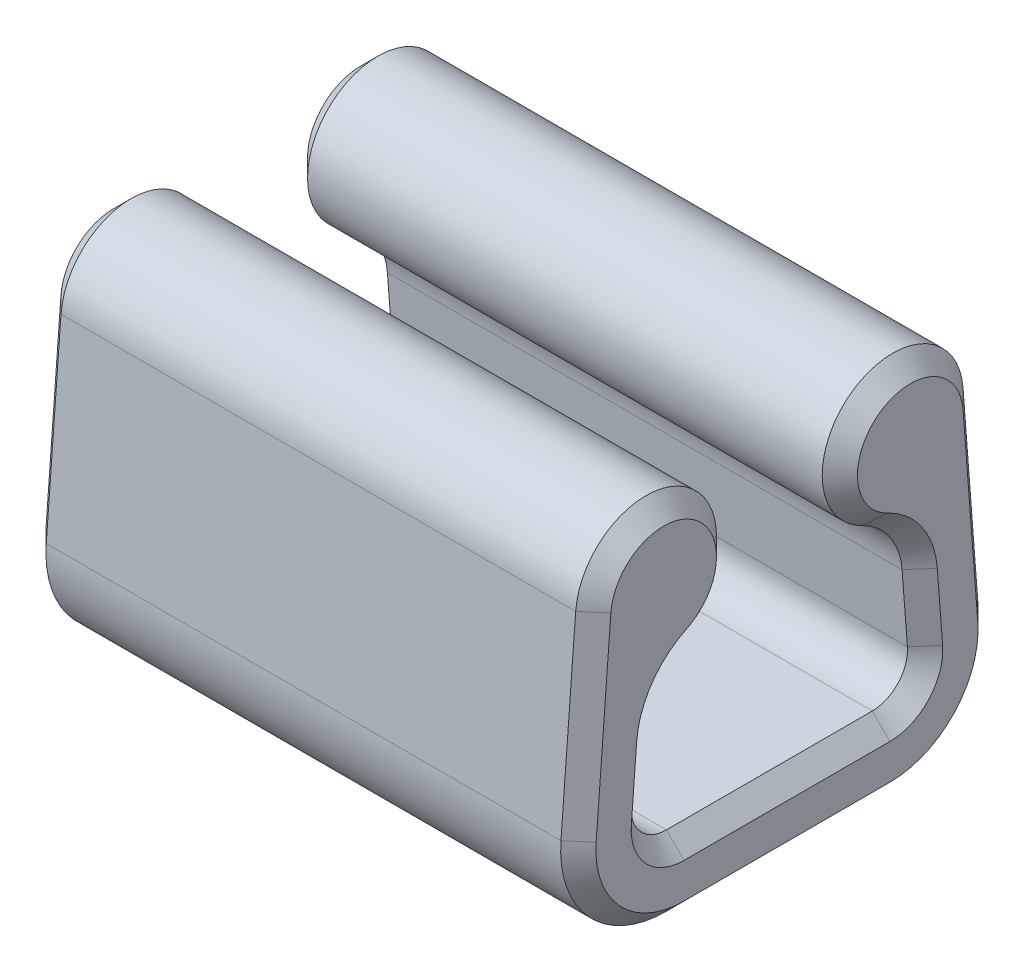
ISO-10303-21;
HEADER;
FILE_DESCRIPTION(('STEP AP214'),'2;1');
FILE_NAME('part.step','',(''),(''),'','','');
FILE_SCHEMA(('AUTOMOTIVE_DESIGN { 1 0 10303 214 1 1 1 1 }'));
ENDSEC;
DATA;
#1=APPLICATION_CONTEXT('core data for automotive mechanical design processes');
#2=APPLICATION_PROTOCOL_DEFINITION('international standard','automotive_design',2000,#1);
#3=PRODUCT_CONTEXT('',#1,'mechanical');
#4=PRODUCT('Part','Part','',(#3));
#5=PRODUCT_RELATED_PRODUCT_CATEGORY('part','',(#4));
#6=PRODUCT_DEFINITION_FORMATION('','',#4);
#7=PRODUCT_DEFINITION_CONTEXT('part definition',#1,'design');
#8=PRODUCT_DEFINITION('design','',#6,#7);
#9=PRODUCT_DEFINITION_SHAPE('','',#8);
#10=(LENGTH_UNIT() NAMED_UNIT(*) SI_UNIT(.MILLI.,.METRE.));
#11=(NAMED_UNIT(*) PLANE_ANGLE_UNIT() SI_UNIT($,.RADIAN.));
#12=(NAMED_UNIT(*) SI_UNIT($,.STERADIAN.) SOLID_ANGLE_UNIT());
#13=UNCERTAINTY_MEASURE_WITH_UNIT(LENGTH_MEASURE(1.E-05),#10,'distance_accuracy_value','');
#14=(GEOMETRIC_REPRESENTATION_CONTEXT(3) GLOBAL_UNCERTAINTY_ASSIGNED_CONTEXT((#13)) GLOBAL_UNIT_ASSIGNED_CONTEXT((#10,
#11,#12)) REPRESENTATION_CONTEXT('',''));
#15=CARTESIAN_POINT('',(0.,0.,0.));
#16=DIRECTION('',(0.,0.,1.));
#17=DIRECTION('',(1.,0.,0.));
#18=AXIS2_PLACEMENT_3D('',#15,#16,#17);
#19=CARTESIAN_POINT('',(7.8,0.,0.));
#20=DIRECTION('',(0.,1.,0.));
#21=DIRECTION('',(0.,0.,1.));
#22=AXIS2_PLACEMENT_3D('',#19,#20,#21);
#23=PLANE('',#22);
#24=DIRECTION('',(-1.,0.,0.));
#25=VECTOR('',#24,1.);
#26=CARTESIAN_POINT('',(7.8,0.,2.92));
#27=LINE('',#26,#25);
#28=CARTESIAN_POINT('',(7.29999999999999,0.,2.92));
#29=VERTEX_POINT('',#28);
#30=CARTESIAN_POINT('',(-7.3,0.,2.92));
#31=VERTEX_POINT('',#30);
#32=EDGE_CURVE('E328',#29,#31,#27,.T.);
#33=ORIENTED_EDGE('',*,*,#32,.T.);
#34=DIRECTION('',(0.,0.,-1.));
#35=VECTOR('',#34,1.);
#36=CARTESIAN_POINT('',(-7.3,0.,0.));
#37=LINE('',#36,#35);
#38=CARTESIAN_POINT('',(-7.3,0.,-2.92));
#39=VERTEX_POINT('',#38);
#40=EDGE_CURVE('E376',#31,#39,#37,.T.);
#41=ORIENTED_EDGE('',*,*,#40,.T.);
#42=DIRECTION('',(-1.,0.,0.));
#43=VECTOR('',#42,1.);
#44=CARTESIAN_POINT('',(7.8,0.,-2.92));
#45=LINE('',#44,#43);
#46=CARTESIAN_POINT('',(7.29999999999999,0.,-2.92));
#47=VERTEX_POINT('',#46);
#48=EDGE_CURVE('E247',#47,#39,#45,.T.);
#49=ORIENTED_EDGE('',*,*,#48,.F.);
#50=DIRECTION('',(0.,0.,1.));
#51=VECTOR('',#50,1.);
#52=CARTESIAN_POINT('',(7.29999999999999,0.,2.92));
#53=LINE('',#52,#51);
#54=EDGE_CURVE('E378',#47,#29,#53,.T.);
#55=ORIENTED_EDGE('',*,*,#54,.T.);
#56=EDGE_LOOP('',(#33,#41,#49,#55));
#57=FACE_BOUND('',#56,.T.);
#58=ADVANCED_FACE('F38',(#57),#23,.F.);
#59=CARTESIAN_POINT('',(7.8,3.,-2.92));
#60=DIRECTION('',(-1.,0.,0.));
#61=DIRECTION('',(0.,0.,1.));
#62=AXIS2_PLACEMENT_3D('',#59,#60,#61);
#63=CYLINDRICAL_SURFACE('',#62,3.);
#64=ORIENTED_EDGE('',*,*,#48,.T.);
#65=CARTESIAN_POINT('',(-7.3,3.,-2.92));
#66=DIRECTION('',(1.,0.,0.));
#67=DIRECTION('',(0.,0.,-1.));
#68=AXIS2_PLACEMENT_3D('',#65,#66,#67);
#69=CIRCLE('',#68,3.);
#70=CARTESIAN_POINT('',(-7.3,3.23015708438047,-5.91115825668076));
#71=VERTEX_POINT('',#70);
#72=EDGE_CURVE('E246',#39,#71,#69,.T.);
#73=ORIENTED_EDGE('',*,*,#72,.T.);
#74=DIRECTION('',(-1.,0.,0.));
#75=VECTOR('',#74,1.);
#76=CARTESIAN_POINT('',(7.8,3.23015708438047,-5.91115825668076));
#77=LINE('',#76,#75);
#78=CARTESIAN_POINT('',(7.29999999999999,3.23015708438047,-5.91115825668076));
#79=VERTEX_POINT('',#78);
#80=EDGE_CURVE('E228',#79,#71,#77,.T.);
#81=ORIENTED_EDGE('',*,*,#80,.F.);
#82=CARTESIAN_POINT('',(7.29999999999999,3.,-2.92));
#83=DIRECTION('',(1.,0.,0.));
#84=DIRECTION('',(0.,0.,-1.));
#85=AXIS2_PLACEMENT_3D('',#82,#83,#84);
#86=CIRCLE('',#85,3.);
#87=EDGE_CURVE('E243',#79,#47,#86,.F.);
#88=ORIENTED_EDGE('',*,*,#87,.T.);
#89=EDGE_LOOP('',(#64,#73,#81,#88));
#90=FACE_BOUND('',#89,.T.);
#91=ADVANCED_FACE('F242',(#90),#63,.T.);
#92=CARTESIAN_POINT('',(7.8,3.23015708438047,-5.91115825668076));
#93=DIRECTION('',(0.,-0.0767190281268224,0.99705275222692));
#94=DIRECTION('',(0.,-0.99705275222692,-0.0767190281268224));
#95=AXIS2_PLACEMENT_3D('',#92,#93,#94);
#96=PLANE('',#95);
#97=ORIENTED_EDGE('',*,*,#80,.T.);
#98=DIRECTION('',(0.,0.99705275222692,0.0767190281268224));
#99=VECTOR('',#98,1.);
#100=CARTESIAN_POINT('',(-7.3,3.23015708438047,-5.91115825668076));
#101=LINE('',#100,#99);
#102=CARTESIAN_POINT('',(-7.3,8.65412405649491,-5.49380674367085));
#103=VERTEX_POINT('',#102);
#104=EDGE_CURVE('E235',#71,#103,#101,.T.);
#105=ORIENTED_EDGE('',*,*,#104,.T.);
#106=DIRECTION('',(-1.,0.,0.));
#107=VECTOR('',#106,1.);
#108=CARTESIAN_POINT('',(7.8,8.65412405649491,-5.49380674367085));
#109=LINE('',#108,#107);
#110=CARTESIAN_POINT('',(7.29999999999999,8.65412405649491,-5.49380674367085));
#111=VERTEX_POINT('',#110);
#112=EDGE_CURVE('E230',#111,#103,#109,.T.);
#113=ORIENTED_EDGE('',*,*,#112,.F.);
#114=DIRECTION('',(0.,-0.99705275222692,-0.0767190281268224));
#115=VECTOR('',#114,1.);
#116=CARTESIAN_POINT('',(7.29999999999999,3.23015708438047,-5.91115825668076));
#117=LINE('',#116,#115);
#118=EDGE_CURVE('E225',#111,#79,#117,.T.);
#119=ORIENTED_EDGE('',*,*,#118,.T.);
#120=EDGE_LOOP('',(#97,#105,#113,#119));
#121=FACE_BOUND('',#120,.T.);
#122=ADVANCED_FACE('F227',(#121),#96,.F.);
#123=CARTESIAN_POINT('',(7.8,8.50068600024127,-3.499701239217));
#124=DIRECTION('',(-1.,0.,0.));
#125=DIRECTION('',(0.,0.,1.));
#126=AXIS2_PLACEMENT_3D('',#123,#124,#125);
#127=CYLINDRICAL_SURFACE('',#126,2.);
#128=ORIENTED_EDGE('',*,*,#112,.T.);
#129=CARTESIAN_POINT('',(-7.3,8.50068600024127,-3.499701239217));
#130=DIRECTION('',(1.,0.,0.));
#131=DIRECTION('',(0.,0.,-1.));
#132=AXIS2_PLACEMENT_3D('',#129,#130,#131);
#133=CIRCLE('',#132,2.);
#134=CARTESIAN_POINT('',(-7.3,6.69702094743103,-2.63552974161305));
#135=VERTEX_POINT('',#134);
#136=EDGE_CURVE('E421',#103,#135,#133,.T.);
#137=ORIENTED_EDGE('',*,*,#136,.T.);
#138=DIRECTION('',(-1.,0.,0.));
#139=VECTOR('',#138,1.);
#140=CARTESIAN_POINT('',(7.8,6.69702094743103,-2.63552974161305));
#141=LINE('',#140,#139);
#142=CARTESIAN_POINT('',(7.29999999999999,6.69702094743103,-2.63552974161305));
#143=VERTEX_POINT('',#142);
#144=EDGE_CURVE('E456',#143,#135,#141,.T.);
#145=ORIENTED_EDGE('',*,*,#144,.F.);
#146=CARTESIAN_POINT('',(7.29999999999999,8.50068600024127,-3.499701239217));
#147=DIRECTION('',(1.,0.,0.));
#148=DIRECTION('',(0.,0.,-1.));
#149=AXIS2_PLACEMENT_3D('',#146,#147,#148);
#150=CIRCLE('',#149,2.);
#151=EDGE_CURVE('E352',#143,#111,#150,.F.);
#152=ORIENTED_EDGE('',*,*,#151,.T.);
#153=EDGE_LOOP('',(#128,#137,#145,#152));
#154=FACE_BOUND('',#153,.T.);
#155=ADVANCED_FACE('F523',(#154),#127,.T.);
#156=CARTESIAN_POINT('',(7.8,4.8933558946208,-1.77135824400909));
#157=DIRECTION('',(-1.,0.,0.));
#158=DIRECTION('',(0.,0.,1.));
#159=AXIS2_PLACEMENT_3D('',#156,#157,#158);
#160=CYLINDRICAL_SURFACE('',#159,2.);
#161=ORIENTED_EDGE('',*,*,#144,.T.);
#162=CARTESIAN_POINT('',(-7.3,4.8933558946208,-1.77135824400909));
#163=DIRECTION('',(1.,0.,0.));
#164=DIRECTION('',(0.,0.,-1.));
#165=AXIS2_PLACEMENT_3D('',#162,#163,#164);
#166=CIRCLE('',#165,2.);
#167=CARTESIAN_POINT('',(-7.3,5.04679395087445,-3.76546374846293));
#168=VERTEX_POINT('',#167);
#169=EDGE_CURVE('E417',#135,#168,#166,.F.);
#170=ORIENTED_EDGE('',*,*,#169,.T.);
#171=DIRECTION('',(-1.,0.,0.));
#172=VECTOR('',#171,1.);
#173=CARTESIAN_POINT('',(7.8,5.04679395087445,-3.76546374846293));
#174=LINE('',#173,#172);
#175=CARTESIAN_POINT('',(7.29999999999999,5.04679395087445,-3.76546374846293));
#176=VERTEX_POINT('',#175);
#177=EDGE_CURVE('E459',#176,#168,#174,.T.);
#178=ORIENTED_EDGE('',*,*,#177,.F.);
#179=CARTESIAN_POINT('',(7.29999999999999,4.8933558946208,-1.77135824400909));
#180=DIRECTION('',(1.,0.,0.));
#181=DIRECTION('',(0.,0.,-1.));
#182=AXIS2_PLACEMENT_3D('',#179,#180,#181);
#183=CIRCLE('',#182,2.);
#184=EDGE_CURVE('E419',#176,#143,#183,.T.);
#185=ORIENTED_EDGE('',*,*,#184,.T.);
#186=EDGE_LOOP('',(#161,#170,#178,#185));
#187=FACE_BOUND('',#186,.T.);
#188=ADVANCED_FACE('F526',(#187),#160,.F.);
#189=CARTESIAN_POINT('',(7.8,5.04679395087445,-3.76546374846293));
#190=DIRECTION('',(0.,0.076719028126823,-0.99705275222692));
#191=DIRECTION('',(0.,0.99705275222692,0.076719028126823));
#192=AXIS2_PLACEMENT_3D('',#189,#190,#191);
#193=PLANE('',#192);
#194=ORIENTED_EDGE('',*,*,#177,.T.);
#195=DIRECTION('',(0.,-0.99705275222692,-0.076719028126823));
#196=VECTOR('',#195,1.);
#197=CARTESIAN_POINT('',(-7.3,5.04679395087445,-3.76546374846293));
#198=LINE('',#197,#196);
#199=CARTESIAN_POINT('',(-7.3,3.07671902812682,-3.91705275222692));
#200=VERTEX_POINT('',#199);
#201=EDGE_CURVE('E413',#168,#200,#198,.T.);
#202=ORIENTED_EDGE('',*,*,#201,.T.);
#203=DIRECTION('',(-1.,0.,0.));
#204=VECTOR('',#203,1.);
#205=CARTESIAN_POINT('',(7.8,3.07671902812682,-3.91705275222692));
#206=LINE('',#205,#204);
#207=CARTESIAN_POINT('',(7.29999999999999,3.07671902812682,-3.91705275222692));
#208=VERTEX_POINT('',#207);
#209=EDGE_CURVE('E462',#208,#200,#206,.T.);
#210=ORIENTED_EDGE('',*,*,#209,.F.);
#211=DIRECTION('',(0.,0.99705275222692,0.076719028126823));
#212=VECTOR('',#211,1.);
#213=CARTESIAN_POINT('',(7.29999999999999,5.04679395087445,-3.76546374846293));
#214=LINE('',#213,#212);
#215=EDGE_CURVE('E415',#208,#176,#214,.T.);
#216=ORIENTED_EDGE('',*,*,#215,.T.);
#217=EDGE_LOOP('',(#194,#202,#210,#216));
#218=FACE_BOUND('',#217,.T.);
#219=ADVANCED_FACE('F530',(#218),#193,.F.);
#220=CARTESIAN_POINT('',(7.8,3.,-2.92));
#221=DIRECTION('',(-1.,0.,0.));
#222=DIRECTION('',(0.,0.,1.));
#223=AXIS2_PLACEMENT_3D('',#220,#221,#222);
#224=CYLINDRICAL_SURFACE('',#223,1.);
#225=ORIENTED_EDGE('',*,*,#209,.T.);
#226=CARTESIAN_POINT('',(-7.3,3.,-2.92));
#227=DIRECTION('',(1.,0.,0.));
#228=DIRECTION('',(0.,0.,-1.));
#229=AXIS2_PLACEMENT_3D('',#226,#227,#228);
#230=CIRCLE('',#229,1.);
#231=CARTESIAN_POINT('',(-7.3,2.,-2.92));
#232=VERTEX_POINT('',#231);
#233=EDGE_CURVE('E408',#200,#232,#230,.F.);
#234=ORIENTED_EDGE('',*,*,#233,.T.);
#235=DIRECTION('',(-1.,0.,0.));
#236=VECTOR('',#235,1.);
#237=CARTESIAN_POINT('',(7.8,2.,-2.92));
#238=LINE('',#237,#236);
#239=CARTESIAN_POINT('',(7.29999999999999,2.,-2.92));
#240=VERTEX_POINT('',#239);
#241=EDGE_CURVE('E465',#240,#232,#238,.T.);
#242=ORIENTED_EDGE('',*,*,#241,.F.);
#243=CARTESIAN_POINT('',(7.29999999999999,3.,-2.92));
#244=DIRECTION('',(1.,0.,0.));
#245=DIRECTION('',(0.,0.,-1.));
#246=AXIS2_PLACEMENT_3D('',#243,#244,#245);
#247=CIRCLE('',#246,1.);
#248=EDGE_CURVE('E410',#240,#208,#247,.T.);
#249=ORIENTED_EDGE('',*,*,#248,.T.);
#250=EDGE_LOOP('',(#225,#234,#242,#249));
#251=FACE_BOUND('',#250,.T.);
#252=ADVANCED_FACE('F534',(#251),#224,.F.);
#253=CARTESIAN_POINT('',(7.8,2.,-2.92));
#254=DIRECTION('',(0.,-1.,0.));
#255=DIRECTION('',(0.,0.,-1.));
#256=AXIS2_PLACEMENT_3D('',#253,#254,#255);
#257=PLANE('',#256);
#258=ORIENTED_EDGE('',*,*,#241,.T.);
#259=DIRECTION('',(0.,0.,1.));
#260=VECTOR('',#259,1.);
#261=CARTESIAN_POINT('',(-7.3,2.,-2.92));
#262=LINE('',#261,#260);
#263=CARTESIAN_POINT('',(-7.3,2.,2.92));
#264=VERTEX_POINT('',#263);
#265=EDGE_CURVE('E404',#232,#264,#262,.T.);
#266=ORIENTED_EDGE('',*,*,#265,.T.);
#267=DIRECTION('',(-1.,0.,0.));
#268=VECTOR('',#267,1.);
#269=CARTESIAN_POINT('',(7.8,2.,2.92));
#270=LINE('',#269,#268);
#271=CARTESIAN_POINT('',(7.29999999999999,2.,2.92));
#272=VERTEX_POINT('',#271);
#273=EDGE_CURVE('E468',#272,#264,#270,.T.);
#274=ORIENTED_EDGE('',*,*,#273,.F.);
#275=DIRECTION('',(0.,0.,-1.));
#276=VECTOR('',#275,1.);
#277=CARTESIAN_POINT('',(7.29999999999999,2.,-2.92));
#278=LINE('',#277,#276);
#279=EDGE_CURVE('E406',#272,#240,#278,.T.);
#280=ORIENTED_EDGE('',*,*,#279,.T.);
#281=EDGE_LOOP('',(#258,#266,#274,#280));
#282=FACE_BOUND('',#281,.T.);
#283=ADVANCED_FACE('F538',(#282),#257,.F.);
#284=CARTESIAN_POINT('',(7.8,3.,-2.92));
#285=DIRECTION('',(1.,0.,0.));
#286=DIRECTION('',(0.,0.,-1.));
#287=AXIS2_PLACEMENT_3D('',#284,#285,#286);
#288=PLANE('',#287);
#289=DIRECTION('',(0.,-0.99705275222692,-0.076719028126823));
#290=VECTOR('',#289,1.);
#291=CARTESIAN_POINT('',(7.8,3.11507854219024,-4.41557912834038));
#292=LINE('',#291,#290);
#293=CARTESIAN_POINT('',(7.8,5.08515346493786,-4.26399012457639));
#294=VERTEX_POINT('',#293);
#295=CARTESIAN_POINT('',(7.8,3.11507854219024,-4.41557912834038));
#296=VERTEX_POINT('',#295);
#297=EDGE_CURVE('E48',#294,#296,#292,.T.);
#298=ORIENTED_EDGE('',*,*,#297,.T.);
#299=CARTESIAN_POINT('',(7.8,3.,-2.92));
#300=DIRECTION('',(1.,0.,0.));
#301=DIRECTION('',(0.,0.,-1.));
#302=AXIS2_PLACEMENT_3D('',#299,#300,#301);
#303=CIRCLE('',#302,1.5);
#304=CARTESIAN_POINT('',(7.8,1.5,-2.92));
#305=VERTEX_POINT('',#304);
#306=EDGE_CURVE('E11',#296,#305,#303,.F.);
#307=ORIENTED_EDGE('',*,*,#306,.T.);
#308=DIRECTION('',(0.,0.,1.));
#309=VECTOR('',#308,1.);
#310=CARTESIAN_POINT('',(7.8,1.5,2.92));
#311=LINE('',#310,#309);
#312=CARTESIAN_POINT('',(7.8,1.5,2.92));
#313=VERTEX_POINT('',#312);
#314=EDGE_CURVE('E374',#305,#313,#311,.T.);
#315=ORIENTED_EDGE('',*,*,#314,.T.);
#316=CARTESIAN_POINT('',(7.8,3.,2.92));
#317=DIRECTION('',(1.,0.,0.));
#318=DIRECTION('',(0.,0.,-1.));
#319=AXIS2_PLACEMENT_3D('',#316,#317,#318);
#320=CIRCLE('',#319,1.5);
#321=CARTESIAN_POINT('',(7.8,3.11507854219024,4.41557912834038));
#322=VERTEX_POINT('',#321);
#323=EDGE_CURVE('E372',#313,#322,#320,.F.);
#324=ORIENTED_EDGE('',*,*,#323,.T.);
#325=DIRECTION('',(0.,0.99705275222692,-0.076719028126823));
#326=VECTOR('',#325,1.);
#327=CARTESIAN_POINT('',(7.8,3.56179718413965,4.38120600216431));
#328=LINE('',#327,#326);
#329=CARTESIAN_POINT('',(7.8,5.08515346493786,4.26399012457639));
#330=VERTEX_POINT('',#329);
#331=EDGE_CURVE('E370',#322,#330,#328,.T.);
#332=ORIENTED_EDGE('',*,*,#331,.T.);
#333=CARTESIAN_POINT('',(7.8,4.8933558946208,1.77135824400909));
#334=DIRECTION('',(1.,0.,0.));
#335=DIRECTION('',(0.,0.,-1.));
#336=AXIS2_PLACEMENT_3D('',#333,#334,#335);
#337=CIRCLE('',#336,2.5);
#338=CARTESIAN_POINT('',(7.8,7.1479372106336,2.85157261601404));
#339=VERTEX_POINT('',#338);
#340=EDGE_CURVE('E368',#330,#339,#337,.F.);
#341=ORIENTED_EDGE('',*,*,#340,.T.);
#342=CARTESIAN_POINT('',(7.8,8.50068600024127,3.499701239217));
#343=DIRECTION('',(1.,0.,0.));
#344=DIRECTION('',(0.,0.,-1.));
#345=AXIS2_PLACEMENT_3D('',#342,#343,#344);
#346=CIRCLE('',#345,1.5);
#347=CARTESIAN_POINT('',(7.8,8.6157645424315,4.99528036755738));
#348=VERTEX_POINT('',#347);
#349=EDGE_CURVE('E366',#339,#348,#346,.T.);
#350=ORIENTED_EDGE('',*,*,#349,.T.);
#351=DIRECTION('',(0.,-0.99705275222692,0.0767190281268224));
#352=VECTOR('',#351,1.);
#353=CARTESIAN_POINT('',(7.8,3.63851621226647,5.37825875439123));
#354=LINE('',#353,#352);
#355=CARTESIAN_POINT('',(7.8,3.19179757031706,5.4126318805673));
#356=VERTEX_POINT('',#355);
#357=EDGE_CURVE('E364',#348,#356,#354,.T.);
#358=ORIENTED_EDGE('',*,*,#357,.T.);
#359=CARTESIAN_POINT('',(7.8,3.,2.92));
#360=DIRECTION('',(1.,0.,0.));
#361=DIRECTION('',(0.,0.,-1.));
#362=AXIS2_PLACEMENT_3D('',#359,#360,#361);
#363=CIRCLE('',#362,2.5);
#364=CARTESIAN_POINT('',(7.8,0.500000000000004,2.92));
#365=VERTEX_POINT('',#364);
#366=EDGE_CURVE('E362',#356,#365,#363,.T.);
#367=ORIENTED_EDGE('',*,*,#366,.T.);
#368=DIRECTION('',(0.,0.,-1.));
#369=VECTOR('',#368,1.);
#370=CARTESIAN_POINT('',(7.8,0.500000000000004,-2.92));
#371=LINE('',#370,#369);
#372=CARTESIAN_POINT('',(7.8,0.500000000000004,-2.92));
#373=VERTEX_POINT('',#372);
#374=EDGE_CURVE('E360',#365,#373,#371,.T.);
#375=ORIENTED_EDGE('',*,*,#374,.T.);
#376=CARTESIAN_POINT('',(7.8,3.,-2.92));
#377=DIRECTION('',(1.,0.,0.));
#378=DIRECTION('',(0.,0.,-1.));
#379=AXIS2_PLACEMENT_3D('',#376,#377,#378);
#380=CIRCLE('',#379,2.5);
#381=CARTESIAN_POINT('',(7.8,3.19179757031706,-5.4126318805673));
#382=VERTEX_POINT('',#381);
#383=EDGE_CURVE('E356',#373,#382,#380,.T.);
#384=ORIENTED_EDGE('',*,*,#383,.T.);
#385=DIRECTION('',(0.,0.99705275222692,0.0767190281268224));
#386=VECTOR('',#385,1.);
#387=CARTESIAN_POINT('',(7.8,8.6157645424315,-4.99528036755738));
#388=LINE('',#387,#386);
#389=CARTESIAN_POINT('',(7.8,8.6157645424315,-4.99528036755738));
#390=VERTEX_POINT('',#389);
#391=EDGE_CURVE('E260',#382,#390,#388,.T.);
#392=ORIENTED_EDGE('',*,*,#391,.T.);
#393=CARTESIAN_POINT('',(7.8,8.50068600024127,-3.499701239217));
#394=DIRECTION('',(1.,0.,0.));
#395=DIRECTION('',(0.,0.,-1.));
#396=AXIS2_PLACEMENT_3D('',#393,#394,#395);
#397=CIRCLE('',#396,1.5);
#398=CARTESIAN_POINT('',(7.8,7.1479372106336,-2.85157261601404));
#399=VERTEX_POINT('',#398);
#400=EDGE_CURVE('E353',#390,#399,#397,.T.);
#401=ORIENTED_EDGE('',*,*,#400,.T.);
#402=CARTESIAN_POINT('',(7.8,4.8933558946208,-1.77135824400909));
#403=DIRECTION('',(1.,0.,0.));
#404=DIRECTION('',(0.,0.,-1.));
#405=AXIS2_PLACEMENT_3D('',#402,#403,#404);
#406=CIRCLE('',#405,2.5);
#407=EDGE_CURVE('E59',#399,#294,#406,.F.);
#408=ORIENTED_EDGE('',*,*,#407,.T.);
#409=EDGE_LOOP('',(#298,#307,#315,#324,#332,#341,#350,#358,#367,#375,#384,#392,#401,#408));
#410=FACE_BOUND('',#409,.T.);
#411=ADVANCED_FACE('F542',(#410),#288,.T.);
#412=CARTESIAN_POINT('',(-7.8,3.,-2.92));
#413=DIRECTION('',(1.,0.,0.));
#414=DIRECTION('',(0.,0.,-1.));
#415=AXIS2_PLACEMENT_3D('',#412,#413,#414);
#416=PLANE('',#415);
#417=DIRECTION('',(0.,-0.99705275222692,-0.0767190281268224));
#418=VECTOR('',#417,1.);
#419=CARTESIAN_POINT('',(-7.8,3.19179757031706,-5.41263188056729));
#420=LINE('',#419,#418);
#421=CARTESIAN_POINT('',(-7.8,8.6157645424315,-4.99528036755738));
#422=VERTEX_POINT('',#421);
#423=CARTESIAN_POINT('',(-7.8,3.19179757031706,-5.41263188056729));
#424=VERTEX_POINT('',#423);
#425=EDGE_CURVE('E427',#422,#424,#420,.T.);
#426=ORIENTED_EDGE('',*,*,#425,.T.);
#427=CARTESIAN_POINT('',(-7.8,3.,-2.92));
#428=DIRECTION('',(1.,0.,0.));
#429=DIRECTION('',(0.,0.,-1.));
#430=AXIS2_PLACEMENT_3D('',#427,#428,#429);
#431=CIRCLE('',#430,2.49999999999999);
#432=CARTESIAN_POINT('',(-7.8,0.500000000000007,-2.92));
#433=VERTEX_POINT('',#432);
#434=EDGE_CURVE('E236',#424,#433,#431,.F.);
#435=ORIENTED_EDGE('',*,*,#434,.T.);
#436=DIRECTION('',(0.,0.,1.));
#437=VECTOR('',#436,1.);
#438=CARTESIAN_POINT('',(-7.8,0.500000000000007,-2.92));
#439=LINE('',#438,#437);
#440=CARTESIAN_POINT('',(-7.8,0.500000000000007,2.92));
#441=VERTEX_POINT('',#440);
#442=EDGE_CURVE('E451',#433,#441,#439,.T.);
#443=ORIENTED_EDGE('',*,*,#442,.T.);
#444=CARTESIAN_POINT('',(-7.8,3.,2.92));
#445=DIRECTION('',(1.,0.,0.));
#446=DIRECTION('',(0.,0.,-1.));
#447=AXIS2_PLACEMENT_3D('',#444,#445,#446);
#448=CIRCLE('',#447,2.49999999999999);
#449=CARTESIAN_POINT('',(-7.8,3.19179757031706,5.41263188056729));
#450=VERTEX_POINT('',#449);
#451=EDGE_CURVE('E449',#441,#450,#448,.F.);
#452=ORIENTED_EDGE('',*,*,#451,.T.);
#453=DIRECTION('',(0.,0.99705275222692,-0.0767190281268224));
#454=VECTOR('',#453,1.);
#455=CARTESIAN_POINT('',(-7.8,8.6157645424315,4.99528036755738));
#456=LINE('',#455,#454);
#457=CARTESIAN_POINT('',(-7.8,8.6157645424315,4.99528036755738));
#458=VERTEX_POINT('',#457);
#459=EDGE_CURVE('E447',#450,#458,#456,.T.);
#460=ORIENTED_EDGE('',*,*,#459,.T.);
#461=CARTESIAN_POINT('',(-7.8,8.50068600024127,3.499701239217));
#462=DIRECTION('',(1.,0.,0.));
#463=DIRECTION('',(0.,0.,-1.));
#464=AXIS2_PLACEMENT_3D('',#461,#462,#463);
#465=CIRCLE('',#464,1.49999999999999);
#466=CARTESIAN_POINT('',(-7.8,7.1479372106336,2.85157261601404));
#467=VERTEX_POINT('',#466);
#468=EDGE_CURVE('E445',#458,#467,#465,.F.);
#469=ORIENTED_EDGE('',*,*,#468,.T.);
#470=CARTESIAN_POINT('',(-7.8,4.8933558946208,1.77135824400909));
#471=DIRECTION('',(1.,0.,0.));
#472=DIRECTION('',(0.,0.,-1.));
#473=AXIS2_PLACEMENT_3D('',#470,#471,#472);
#474=CIRCLE('',#473,2.50000000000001);
#475=CARTESIAN_POINT('',(-7.8,5.08515346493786,4.2639901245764));
#476=VERTEX_POINT('',#475);
#477=EDGE_CURVE('E443',#467,#476,#474,.T.);
#478=ORIENTED_EDGE('',*,*,#477,.T.);
#479=DIRECTION('',(0.,-0.99705275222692,0.076719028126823));
#480=VECTOR('',#479,1.);
#481=CARTESIAN_POINT('',(-7.8,3.11507854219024,4.41557912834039));
#482=LINE('',#481,#480);
#483=CARTESIAN_POINT('',(-7.8,3.11507854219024,4.41557912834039));
#484=VERTEX_POINT('',#483);
#485=EDGE_CURVE('E441',#476,#484,#482,.T.);
#486=ORIENTED_EDGE('',*,*,#485,.T.);
#487=CARTESIAN_POINT('',(-7.8,3.,2.92));
#488=DIRECTION('',(1.,0.,0.));
#489=DIRECTION('',(0.,0.,-1.));
#490=AXIS2_PLACEMENT_3D('',#487,#488,#489);
#491=CIRCLE('',#490,1.50000000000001);
#492=CARTESIAN_POINT('',(-7.8,1.49999999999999,2.92));
#493=VERTEX_POINT('',#492);
#494=EDGE_CURVE('E439',#484,#493,#491,.T.);
#495=ORIENTED_EDGE('',*,*,#494,.T.);
#496=DIRECTION('',(0.,0.,-1.));
#497=VECTOR('',#496,1.);
#498=CARTESIAN_POINT('',(-7.8,1.49999999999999,-2.92));
#499=LINE('',#498,#497);
#500=CARTESIAN_POINT('',(-7.8,1.49999999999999,-2.92));
#501=VERTEX_POINT('',#500);
#502=EDGE_CURVE('E437',#493,#501,#499,.T.);
#503=ORIENTED_EDGE('',*,*,#502,.T.);
#504=CARTESIAN_POINT('',(-7.8,3.,-2.92));
#505=DIRECTION('',(1.,0.,0.));
#506=DIRECTION('',(0.,0.,-1.));
#507=AXIS2_PLACEMENT_3D('',#504,#505,#506);
#508=CIRCLE('',#507,1.50000000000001);
#509=CARTESIAN_POINT('',(-7.8,3.11507854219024,-4.41557912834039));
#510=VERTEX_POINT('',#509);
#511=EDGE_CURVE('E435',#501,#510,#508,.T.);
#512=ORIENTED_EDGE('',*,*,#511,.T.);
#513=DIRECTION('',(0.,0.99705275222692,0.076719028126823));
#514=VECTOR('',#513,1.);
#515=CARTESIAN_POINT('',(-7.8,3.11507854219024,-4.41557912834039));
#516=LINE('',#515,#514);
#517=CARTESIAN_POINT('',(-7.8,5.08515346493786,-4.2639901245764));
#518=VERTEX_POINT('',#517);
#519=EDGE_CURVE('E433',#510,#518,#516,.T.);
#520=ORIENTED_EDGE('',*,*,#519,.T.);
#521=CARTESIAN_POINT('',(-7.8,4.8933558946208,-1.77135824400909));
#522=DIRECTION('',(1.,0.,0.));
#523=DIRECTION('',(0.,0.,-1.));
#524=AXIS2_PLACEMENT_3D('',#521,#522,#523);
#525=CIRCLE('',#524,2.50000000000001);
#526=CARTESIAN_POINT('',(-7.8,7.1479372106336,-2.85157261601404));
#527=VERTEX_POINT('',#526);
#528=EDGE_CURVE('E431',#518,#527,#525,.T.);
#529=ORIENTED_EDGE('',*,*,#528,.T.);
#530=CARTESIAN_POINT('',(-7.8,8.50068600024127,-3.499701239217));
#531=DIRECTION('',(1.,0.,0.));
#532=DIRECTION('',(0.,0.,-1.));
#533=AXIS2_PLACEMENT_3D('',#530,#531,#532);
#534=CIRCLE('',#533,1.49999999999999);
#535=EDGE_CURVE('E429',#527,#422,#534,.F.);
#536=ORIENTED_EDGE('',*,*,#535,.T.);
#537=EDGE_LOOP('',(#426,#435,#443,#452,#460,#469,#478,#486,#495,#503,#512,#520,#529,#536));
#538=FACE_BOUND('',#537,.T.);
#539=ADVANCED_FACE('F544',(#538),#416,.F.);
#540=CARTESIAN_POINT('',(7.8,3.,2.92));
#541=DIRECTION('',(-1.,0.,0.));
#542=DIRECTION('',(0.,0.,1.));
#543=AXIS2_PLACEMENT_3D('',#540,#541,#542);
#544=CYLINDRICAL_SURFACE('',#543,1.);
#545=ORIENTED_EDGE('',*,*,#273,.T.);
#546=CARTESIAN_POINT('',(-7.3,3.,2.92));
#547=DIRECTION('',(1.,0.,0.));
#548=DIRECTION('',(0.,0.,-1.));
#549=AXIS2_PLACEMENT_3D('',#546,#547,#548);
#550=CIRCLE('',#549,1.);
#551=CARTESIAN_POINT('',(-7.3,3.07671902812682,3.91705275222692));
#552=VERTEX_POINT('',#551);
#553=EDGE_CURVE('E400',#264,#552,#550,.F.);
#554=ORIENTED_EDGE('',*,*,#553,.T.);
#555=DIRECTION('',(-1.,0.,0.));
#556=VECTOR('',#555,1.);
#557=CARTESIAN_POINT('',(7.8,3.07671902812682,3.91705275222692));
#558=LINE('',#557,#556);
#559=CARTESIAN_POINT('',(7.29999999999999,3.07671902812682,3.91705275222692));
#560=VERTEX_POINT('',#559);
#561=EDGE_CURVE('E471',#560,#552,#558,.T.);
#562=ORIENTED_EDGE('',*,*,#561,.F.);
#563=CARTESIAN_POINT('',(7.29999999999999,3.,2.92));
#564=DIRECTION('',(1.,0.,0.));
#565=DIRECTION('',(0.,0.,-1.));
#566=AXIS2_PLACEMENT_3D('',#563,#564,#565);
#567=CIRCLE('',#566,1.);
#568=EDGE_CURVE('E402',#560,#272,#567,.T.);
#569=ORIENTED_EDGE('',*,*,#568,.T.);
#570=EDGE_LOOP('',(#545,#554,#562,#569));
#571=FACE_BOUND('',#570,.T.);
#572=ADVANCED_FACE('F547',(#571),#544,.F.);
#573=CARTESIAN_POINT('',(7.8,5.04679395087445,3.76546374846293));
#574=DIRECTION('',(0.,-0.076719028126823,-0.99705275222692));
#575=DIRECTION('',(0.,0.99705275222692,-0.076719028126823));
#576=AXIS2_PLACEMENT_3D('',#573,#574,#575);
#577=PLANE('',#576);
#578=ORIENTED_EDGE('',*,*,#561,.T.);
#579=DIRECTION('',(0.,0.99705275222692,-0.076719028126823));
#580=VECTOR('',#579,1.);
#581=CARTESIAN_POINT('',(-7.3,5.04679395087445,3.76546374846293));
#582=LINE('',#581,#580);
#583=CARTESIAN_POINT('',(-7.3,5.04679395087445,3.76546374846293));
#584=VERTEX_POINT('',#583);
#585=EDGE_CURVE('E396',#552,#584,#582,.T.);
#586=ORIENTED_EDGE('',*,*,#585,.T.);
#587=DIRECTION('',(-1.,0.,0.));
#588=VECTOR('',#587,1.);
#589=CARTESIAN_POINT('',(7.8,5.04679395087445,3.76546374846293));
#590=LINE('',#589,#588);
#591=CARTESIAN_POINT('',(7.29999999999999,5.04679395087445,3.76546374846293));
#592=VERTEX_POINT('',#591);
#593=EDGE_CURVE('E474',#592,#584,#590,.T.);
#594=ORIENTED_EDGE('',*,*,#593,.F.);
#595=DIRECTION('',(0.,-0.99705275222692,0.076719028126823));
#596=VECTOR('',#595,1.);
#597=CARTESIAN_POINT('',(7.29999999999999,5.04679395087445,3.76546374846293));
#598=LINE('',#597,#596);
#599=EDGE_CURVE('E398',#592,#560,#598,.T.);
#600=ORIENTED_EDGE('',*,*,#599,.T.);
#601=EDGE_LOOP('',(#578,#586,#594,#600));
#602=FACE_BOUND('',#601,.T.);
#603=ADVANCED_FACE('F553',(#602),#577,.T.);
#604=CARTESIAN_POINT('',(7.8,4.8933558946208,1.77135824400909));
#605=DIRECTION('',(-1.,0.,0.));
#606=DIRECTION('',(0.,0.,1.));
#607=AXIS2_PLACEMENT_3D('',#604,#605,#606);
#608=CYLINDRICAL_SURFACE('',#607,2.);
#609=ORIENTED_EDGE('',*,*,#593,.T.);
#610=CARTESIAN_POINT('',(-7.3,4.8933558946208,1.77135824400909));
#611=DIRECTION('',(1.,0.,0.));
#612=DIRECTION('',(0.,0.,-1.));
#613=AXIS2_PLACEMENT_3D('',#610,#611,#612);
#614=CIRCLE('',#613,2.);
#615=CARTESIAN_POINT('',(-7.3,6.69702094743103,2.63552974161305));
#616=VERTEX_POINT('',#615);
#617=EDGE_CURVE('E392',#584,#616,#614,.F.);
#618=ORIENTED_EDGE('',*,*,#617,.T.);
#619=DIRECTION('',(-1.,0.,0.));
#620=VECTOR('',#619,1.);
#621=CARTESIAN_POINT('',(7.8,6.69702094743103,2.63552974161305));
#622=LINE('',#621,#620);
#623=CARTESIAN_POINT('',(7.29999999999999,6.69702094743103,2.63552974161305));
#624=VERTEX_POINT('',#623);
#625=EDGE_CURVE('E477',#624,#616,#622,.T.);
#626=ORIENTED_EDGE('',*,*,#625,.F.);
#627=CARTESIAN_POINT('',(7.29999999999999,4.8933558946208,1.77135824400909));
#628=DIRECTION('',(1.,0.,0.));
#629=DIRECTION('',(0.,0.,-1.));
#630=AXIS2_PLACEMENT_3D('',#627,#628,#629);
#631=CIRCLE('',#630,2.);
#632=EDGE_CURVE('E394',#624,#592,#631,.T.);
#633=ORIENTED_EDGE('',*,*,#632,.T.);
#634=EDGE_LOOP('',(#609,#618,#626,#633));
#635=FACE_BOUND('',#634,.T.);
#636=ADVANCED_FACE('F557',(#635),#608,.F.);
#637=CARTESIAN_POINT('',(7.8,8.50068600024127,3.499701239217));
#638=DIRECTION('',(-1.,0.,0.));
#639=DIRECTION('',(0.,0.,1.));
#640=AXIS2_PLACEMENT_3D('',#637,#638,#639);
#641=CYLINDRICAL_SURFACE('',#640,2.);
#642=ORIENTED_EDGE('',*,*,#625,.T.);
#643=CARTESIAN_POINT('',(-7.3,8.50068600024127,3.499701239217));
#644=DIRECTION('',(1.,0.,0.));
#645=DIRECTION('',(0.,0.,-1.));
#646=AXIS2_PLACEMENT_3D('',#643,#644,#645);
#647=CIRCLE('',#646,2.);
#648=CARTESIAN_POINT('',(-7.3,8.65412405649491,5.49380674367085));
#649=VERTEX_POINT('',#648);
#650=EDGE_CURVE('E388',#616,#649,#647,.T.);
#651=ORIENTED_EDGE('',*,*,#650,.T.);
#652=DIRECTION('',(-1.,0.,0.));
#653=VECTOR('',#652,1.);
#654=CARTESIAN_POINT('',(7.8,8.65412405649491,5.49380674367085));
#655=LINE('',#654,#653);
#656=CARTESIAN_POINT('',(7.29999999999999,8.65412405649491,5.49380674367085));
#657=VERTEX_POINT('',#656);
#658=EDGE_CURVE('E480',#657,#649,#655,.T.);
#659=ORIENTED_EDGE('',*,*,#658,.F.);
#660=CARTESIAN_POINT('',(7.29999999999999,8.50068600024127,3.499701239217));
#661=DIRECTION('',(1.,0.,0.));
#662=DIRECTION('',(0.,0.,-1.));
#663=AXIS2_PLACEMENT_3D('',#660,#661,#662);
#664=CIRCLE('',#663,2.);
#665=EDGE_CURVE('E390',#657,#624,#664,.F.);
#666=ORIENTED_EDGE('',*,*,#665,.T.);
#667=EDGE_LOOP('',(#642,#651,#659,#666));
#668=FACE_BOUND('',#667,.T.);
#669=ADVANCED_FACE('F561',(#668),#641,.T.);
#670=CARTESIAN_POINT('',(7.8,3.23015708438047,5.91115825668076));
#671=DIRECTION('',(0.,0.0767190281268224,0.99705275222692));
#672=DIRECTION('',(0.,-0.99705275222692,0.0767190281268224));
#673=AXIS2_PLACEMENT_3D('',#670,#671,#672);
#674=PLANE('',#673);
#675=ORIENTED_EDGE('',*,*,#658,.T.);
#676=DIRECTION('',(0.,-0.99705275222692,0.0767190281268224));
#677=VECTOR('',#676,1.);
#678=CARTESIAN_POINT('',(-7.3,3.23015708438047,5.91115825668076));
#679=LINE('',#678,#677);
#680=CARTESIAN_POINT('',(-7.3,3.23015708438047,5.91115825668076));
#681=VERTEX_POINT('',#680);
#682=EDGE_CURVE('E384',#649,#681,#679,.T.);
#683=ORIENTED_EDGE('',*,*,#682,.T.);
#684=DIRECTION('',(-1.,0.,0.));
#685=VECTOR('',#684,1.);
#686=CARTESIAN_POINT('',(7.8,3.23015708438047,5.91115825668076));
#687=LINE('',#686,#685);
#688=CARTESIAN_POINT('',(7.29999999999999,3.23015708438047,5.91115825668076));
#689=VERTEX_POINT('',#688);
#690=EDGE_CURVE('E483',#689,#681,#687,.T.);
#691=ORIENTED_EDGE('',*,*,#690,.F.);
#692=DIRECTION('',(0.,0.99705275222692,-0.0767190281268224));
#693=VECTOR('',#692,1.);
#694=CARTESIAN_POINT('',(7.29999999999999,3.23015708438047,5.91115825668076));
#695=LINE('',#694,#693);
#696=EDGE_CURVE('E386',#689,#657,#695,.T.);
#697=ORIENTED_EDGE('',*,*,#696,.T.);
#698=EDGE_LOOP('',(#675,#683,#691,#697));
#699=FACE_BOUND('',#698,.T.);
#700=ADVANCED_FACE('F565',(#699),#674,.T.);
#701=CARTESIAN_POINT('',(7.8,3.,2.92));
#702=DIRECTION('',(-1.,0.,0.));
#703=DIRECTION('',(0.,0.,1.));
#704=AXIS2_PLACEMENT_3D('',#701,#702,#703);
#705=CYLINDRICAL_SURFACE('',#704,3.);
#706=ORIENTED_EDGE('',*,*,#690,.T.);
#707=CARTESIAN_POINT('',(-7.3,3.,2.92));
#708=DIRECTION('',(1.,0.,0.));
#709=DIRECTION('',(0.,0.,-1.));
#710=AXIS2_PLACEMENT_3D('',#707,#708,#709);
#711=CIRCLE('',#710,3.);
#712=EDGE_CURVE('E380',#681,#31,#711,.T.);
#713=ORIENTED_EDGE('',*,*,#712,.T.);
#714=ORIENTED_EDGE('',*,*,#32,.F.);
#715=CARTESIAN_POINT('',(7.29999999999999,3.,2.92));
#716=DIRECTION('',(1.,0.,0.));
#717=DIRECTION('',(0.,0.,-1.));
#718=AXIS2_PLACEMENT_3D('',#715,#716,#717);
#719=CIRCLE('',#718,3.);
#720=EDGE_CURVE('E382',#29,#689,#719,.F.);
#721=ORIENTED_EDGE('',*,*,#720,.T.);
#722=EDGE_LOOP('',(#706,#713,#714,#721));
#723=FACE_BOUND('',#722,.T.);
#724=ADVANCED_FACE('F569',(#723),#705,.T.);
#725=CARTESIAN_POINT('',(-7.8,3.,2.92));
#726=DIRECTION('',(-1.,0.,0.));
#727=DIRECTION('',(0.,0.,1.));
#728=AXIS2_PLACEMENT_3D('',#725,#726,#727);
#729=CONICAL_SURFACE('',#728,1.50000000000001,0.785398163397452);
#730=DIRECTION('',(0.707106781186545,0.70710678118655,0.));
#731=VECTOR('',#730,1.);
#732=CARTESIAN_POINT('',(-7.8,1.49999999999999,2.92));
#733=LINE('',#732,#731);
#734=EDGE_CURVE('E322',#493,#264,#733,.T.);
#735=ORIENTED_EDGE('',*,*,#734,.F.);
#736=ORIENTED_EDGE('',*,*,#494,.F.);
#737=DIRECTION('',(-0.707106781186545,0.0542485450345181,0.705022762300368));
#738=VECTOR('',#737,1.);
#739=CARTESIAN_POINT('',(-7.3,3.07671902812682,3.91705275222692));
#740=LINE('',#739,#738);
#741=EDGE_CURVE('E325',#552,#484,#740,.T.);
#742=ORIENTED_EDGE('',*,*,#741,.F.);
#743=ORIENTED_EDGE('',*,*,#553,.F.);
#744=EDGE_LOOP('',(#735,#736,#742,#743));
#745=FACE_BOUND('',#744,.T.);
#746=ADVANCED_FACE('F572',(#745),#729,.F.);
#747=CARTESIAN_POINT('',(-7.8,3.56179718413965,4.38120600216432));
#748=DIRECTION('',(-0.70710678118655,-0.0542485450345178,-0.705022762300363));
#749=DIRECTION('',(0.,0.99705275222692,-0.076719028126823));
#750=AXIS2_PLACEMENT_3D('',#747,#748,#749);
#751=PLANE('',#750);
#752=ORIENTED_EDGE('',*,*,#741,.T.);
#753=ORIENTED_EDGE('',*,*,#485,.F.);
#754=DIRECTION('',(-0.707106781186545,0.0542485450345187,0.705022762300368));
#755=VECTOR('',#754,1.);
#756=CARTESIAN_POINT('',(-7.3,5.04679395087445,3.76546374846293));
#757=LINE('',#756,#755);
#758=EDGE_CURVE('E319',#584,#476,#757,.T.);
#759=ORIENTED_EDGE('',*,*,#758,.F.);
#760=ORIENTED_EDGE('',*,*,#585,.F.);
#761=EDGE_LOOP('',(#752,#753,#759,#760));
#762=FACE_BOUND('',#761,.T.);
#763=ADVANCED_FACE('F576',(#762),#751,.T.);
#764=CARTESIAN_POINT('',(-7.3,2.,-2.92));
#765=DIRECTION('',(0.70710678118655,-0.707106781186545,0.));
#766=DIRECTION('',(0.,0.,1.));
#767=AXIS2_PLACEMENT_3D('',#764,#765,#766);
#768=PLANE('',#767);
#769=ORIENTED_EDGE('',*,*,#734,.T.);
#770=ORIENTED_EDGE('',*,*,#265,.F.);
#771=DIRECTION('',(0.707106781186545,0.70710678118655,0.));
#772=VECTOR('',#771,1.);
#773=CARTESIAN_POINT('',(-7.8,1.49999999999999,-2.92));
#774=LINE('',#773,#772);
#775=EDGE_CURVE('E316',#501,#232,#774,.T.);
#776=ORIENTED_EDGE('',*,*,#775,.F.);
#777=ORIENTED_EDGE('',*,*,#502,.F.);
#778=EDGE_LOOP('',(#769,#770,#776,#777));
#779=FACE_BOUND('',#778,.T.);
#780=ADVANCED_FACE('F609',(#779),#768,.F.);
#781=CARTESIAN_POINT('',(-7.8,4.8933558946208,1.77135824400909));
#782=DIRECTION('',(-1.,0.,0.));
#783=DIRECTION('',(0.,0.,1.));
#784=AXIS2_PLACEMENT_3D('',#781,#782,#783);
#785=CONICAL_SURFACE('',#784,2.50000000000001,0.785398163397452);
#786=ORIENTED_EDGE('',*,*,#758,.T.);
#787=ORIENTED_EDGE('',*,*,#477,.F.);
#788=DIRECTION('',(-0.707106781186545,0.637691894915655,0.305530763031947));
#789=VECTOR('',#788,1.);
#790=CARTESIAN_POINT('',(-7.3,6.69702094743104,2.63552974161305));
#791=LINE('',#790,#789);
#792=EDGE_CURVE('E313',#616,#467,#791,.T.);
#793=ORIENTED_EDGE('',*,*,#792,.F.);
#794=ORIENTED_EDGE('',*,*,#617,.F.);
#795=EDGE_LOOP('',(#786,#787,#793,#794));
#796=FACE_BOUND('',#795,.T.);
#797=ADVANCED_FACE('F594',(#796),#785,.F.);
#798=CARTESIAN_POINT('',(-7.3,3.,-2.92));
#799=DIRECTION('',(-1.,0.,0.));
#800=DIRECTION('',(0.,0.,1.));
#801=AXIS2_PLACEMENT_3D('',#798,#799,#800);
#802=CONICAL_SURFACE('',#801,1.,0.785398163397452);
#803=ORIENTED_EDGE('',*,*,#775,.T.);
#804=ORIENTED_EDGE('',*,*,#233,.F.);
#805=DIRECTION('',(0.707106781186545,-0.0542485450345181,0.705022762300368));
#806=VECTOR('',#805,1.);
#807=CARTESIAN_POINT('',(-7.8,3.11507854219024,-4.41557912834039));
#808=LINE('',#807,#806);
#809=EDGE_CURVE('E310',#510,#200,#808,.T.);
#810=ORIENTED_EDGE('',*,*,#809,.F.);
#811=ORIENTED_EDGE('',*,*,#511,.F.);
#812=EDGE_LOOP('',(#803,#804,#810,#811));
#813=FACE_BOUND('',#812,.T.);
#814=ADVANCED_FACE('F612',(#813),#802,.F.);
#815=CARTESIAN_POINT('',(-7.8,8.50068600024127,3.499701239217));
#816=DIRECTION('',(1.,0.,0.));
#817=DIRECTION('',(0.,0.,-1.));
#818=AXIS2_PLACEMENT_3D('',#815,#816,#817);
#819=CONICAL_SURFACE('',#818,1.49999999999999,0.785398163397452);
#820=ORIENTED_EDGE('',*,*,#792,.T.);
#821=ORIENTED_EDGE('',*,*,#468,.F.);
#822=DIRECTION('',(-0.707106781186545,-0.0542485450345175,-0.705022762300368));
#823=VECTOR('',#822,1.);
#824=CARTESIAN_POINT('',(-7.3,8.65412405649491,5.49380674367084));
#825=LINE('',#824,#823);
#826=EDGE_CURVE('E307',#649,#458,#825,.T.);
#827=ORIENTED_EDGE('',*,*,#826,.F.);
#828=ORIENTED_EDGE('',*,*,#650,.F.);
#829=EDGE_LOOP('',(#820,#821,#827,#828));
#830=FACE_BOUND('',#829,.T.);
#831=ADVANCED_FACE('F589',(#830),#819,.T.);
#832=CARTESIAN_POINT('',(-7.3,5.04679395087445,-3.76546374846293));
#833=DIRECTION('',(0.70710678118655,0.0542485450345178,-0.705022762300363));
#834=DIRECTION('',(0.,-0.99705275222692,-0.076719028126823));
#835=AXIS2_PLACEMENT_3D('',#832,#833,#834);
#836=PLANE('',#835);
#837=ORIENTED_EDGE('',*,*,#809,.T.);
#838=ORIENTED_EDGE('',*,*,#201,.F.);
#839=DIRECTION('',(0.707106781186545,-0.0542485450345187,0.705022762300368));
#840=VECTOR('',#839,1.);
#841=CARTESIAN_POINT('',(-7.8,5.08515346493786,-4.2639901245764));
#842=LINE('',#841,#840);
#843=EDGE_CURVE('E304',#518,#168,#842,.T.);
#844=ORIENTED_EDGE('',*,*,#843,.F.);
#845=ORIENTED_EDGE('',*,*,#519,.F.);
#846=EDGE_LOOP('',(#837,#838,#844,#845));
#847=FACE_BOUND('',#846,.T.);
#848=ADVANCED_FACE('F617',(#847),#836,.F.);
#849=CARTESIAN_POINT('',(-7.8,3.63851621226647,5.37825875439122));
#850=DIRECTION('',(-0.707106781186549,0.0542485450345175,0.705022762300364));
#851=DIRECTION('',(0.,-0.99705275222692,0.0767190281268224));
#852=AXIS2_PLACEMENT_3D('',#849,#850,#851);
#853=PLANE('',#852);
#854=ORIENTED_EDGE('',*,*,#826,.T.);
#855=ORIENTED_EDGE('',*,*,#459,.F.);
#856=DIRECTION('',(-0.707106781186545,-0.0542485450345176,-0.705022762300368));
#857=VECTOR('',#856,1.);
#858=CARTESIAN_POINT('',(-7.3,3.23015708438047,5.91115825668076));
#859=LINE('',#858,#857);
#860=EDGE_CURVE('E301',#681,#450,#859,.T.);
#861=ORIENTED_EDGE('',*,*,#860,.F.);
#862=ORIENTED_EDGE('',*,*,#682,.F.);
#863=EDGE_LOOP('',(#854,#855,#861,#862));
#864=FACE_BOUND('',#863,.T.);
#865=ADVANCED_FACE('F584',(#864),#853,.T.);
#866=CARTESIAN_POINT('',(-7.3,4.8933558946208,-1.77135824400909));
#867=DIRECTION('',(-1.,0.,0.));
#868=DIRECTION('',(0.,0.,1.));
#869=AXIS2_PLACEMENT_3D('',#866,#867,#868);
#870=CONICAL_SURFACE('',#869,2.,0.785398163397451);
#871=ORIENTED_EDGE('',*,*,#843,.T.);
#872=ORIENTED_EDGE('',*,*,#169,.F.);
#873=DIRECTION('',(0.707106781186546,-0.637691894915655,0.305530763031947));
#874=VECTOR('',#873,1.);
#875=CARTESIAN_POINT('',(-7.8,7.1479372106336,-2.85157261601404));
#876=LINE('',#875,#874);
#877=EDGE_CURVE('E298',#527,#135,#876,.T.);
#878=ORIENTED_EDGE('',*,*,#877,.F.);
#879=ORIENTED_EDGE('',*,*,#528,.F.);
#880=EDGE_LOOP('',(#871,#872,#878,#879));
#881=FACE_BOUND('',#880,.T.);
#882=ADVANCED_FACE('F624',(#881),#870,.F.);
#883=CARTESIAN_POINT('',(-7.8,3.,2.92));
#884=DIRECTION('',(1.,0.,0.));
#885=DIRECTION('',(0.,0.,-1.));
#886=AXIS2_PLACEMENT_3D('',#883,#884,#885);
#887=CONICAL_SURFACE('',#886,2.49999999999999,0.785398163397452);
#888=ORIENTED_EDGE('',*,*,#860,.T.);
#889=ORIENTED_EDGE('',*,*,#451,.F.);
#890=DIRECTION('',(-0.707106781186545,0.70710678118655,0.));
#891=VECTOR('',#890,1.);
#892=CARTESIAN_POINT('',(-7.3,0.,2.92));
#893=LINE('',#892,#891);
#894=EDGE_CURVE('E295',#31,#441,#893,.T.);
#895=ORIENTED_EDGE('',*,*,#894,.F.);
#896=ORIENTED_EDGE('',*,*,#712,.F.);
#897=EDGE_LOOP('',(#888,#889,#895,#896));
#898=FACE_BOUND('',#897,.T.);
#899=ADVANCED_FACE('F496',(#898),#887,.T.);
#900=CARTESIAN_POINT('',(-7.3,8.50068600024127,-3.499701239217));
#901=DIRECTION('',(1.,0.,0.));
#902=DIRECTION('',(0.,0.,-1.));
#903=AXIS2_PLACEMENT_3D('',#900,#901,#902);
#904=CONICAL_SURFACE('',#903,2.,0.785398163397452);
#905=ORIENTED_EDGE('',*,*,#877,.T.);
#906=ORIENTED_EDGE('',*,*,#136,.F.);
#907=DIRECTION('',(0.707106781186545,0.0542485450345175,-0.705022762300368));
#908=VECTOR('',#907,1.);
#909=CARTESIAN_POINT('',(-7.8,8.6157645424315,-4.99528036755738));
#910=LINE('',#909,#908);
#911=EDGE_CURVE('E289',#422,#103,#910,.T.);
#912=ORIENTED_EDGE('',*,*,#911,.F.);
#913=ORIENTED_EDGE('',*,*,#535,.F.);
#914=EDGE_LOOP('',(#905,#906,#912,#913));
#915=FACE_BOUND('',#914,.T.);
#916=ADVANCED_FACE('F627',(#915),#904,.T.);
#917=CARTESIAN_POINT('',(-7.3,0.,0.));
#918=DIRECTION('',(0.70710678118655,0.707106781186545,0.));
#919=DIRECTION('',(0.,0.,-1.));
#920=AXIS2_PLACEMENT_3D('',#917,#918,#919);
#921=PLANE('',#920);
#922=ORIENTED_EDGE('',*,*,#894,.T.);
#923=ORIENTED_EDGE('',*,*,#442,.F.);
#924=DIRECTION('',(-0.707106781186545,0.70710678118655,0.));
#925=VECTOR('',#924,1.);
#926=CARTESIAN_POINT('',(-7.3,0.,-2.92));
#927=LINE('',#926,#925);
#928=EDGE_CURVE('E283',#39,#433,#927,.T.);
#929=ORIENTED_EDGE('',*,*,#928,.F.);
#930=ORIENTED_EDGE('',*,*,#40,.F.);
#931=EDGE_LOOP('',(#922,#923,#929,#930));
#932=FACE_BOUND('',#931,.T.);
#933=ADVANCED_FACE('F500',(#932),#921,.F.);
#934=CARTESIAN_POINT('',(-7.3,3.23015708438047,-5.91115825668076));
#935=DIRECTION('',(0.70710678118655,-0.0542485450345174,0.705022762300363));
#936=DIRECTION('',(0.,0.99705275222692,0.0767190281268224));
#937=AXIS2_PLACEMENT_3D('',#934,#935,#936);
#938=PLANE('',#937);
#939=ORIENTED_EDGE('',*,*,#911,.T.);
#940=ORIENTED_EDGE('',*,*,#104,.F.);
#941=DIRECTION('',(0.707106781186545,0.0542485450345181,-0.705022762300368));
#942=VECTOR('',#941,1.);
#943=CARTESIAN_POINT('',(-7.8,3.19179757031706,-5.41263188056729));
#944=LINE('',#943,#942);
#945=EDGE_CURVE('E278',#424,#71,#944,.T.);
#946=ORIENTED_EDGE('',*,*,#945,.F.);
#947=ORIENTED_EDGE('',*,*,#425,.F.);
#948=EDGE_LOOP('',(#939,#940,#946,#947));
#949=FACE_BOUND('',#948,.T.);
#950=ADVANCED_FACE('F503',(#949),#938,.F.);
#951=CARTESIAN_POINT('',(-7.3,3.,-2.92));
#952=DIRECTION('',(1.,0.,0.));
#953=DIRECTION('',(0.,0.,-1.));
#954=AXIS2_PLACEMENT_3D('',#951,#952,#953);
#955=CONICAL_SURFACE('',#954,3.,0.785398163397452);
#956=ORIENTED_EDGE('',*,*,#928,.T.);
#957=ORIENTED_EDGE('',*,*,#434,.F.);
#958=ORIENTED_EDGE('',*,*,#945,.T.);
#959=ORIENTED_EDGE('',*,*,#72,.F.);
#960=EDGE_LOOP('',(#956,#957,#958,#959));
#961=FACE_BOUND('',#960,.T.);
#962=ADVANCED_FACE('F501',(#961),#955,.T.);
#963=CARTESIAN_POINT('',(7.29999999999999,3.,2.92));
#964=DIRECTION('',(-1.,0.,0.));
#965=DIRECTION('',(0.,0.,1.));
#966=AXIS2_PLACEMENT_3D('',#963,#964,#965);
#967=CONICAL_SURFACE('',#966,3.,0.785398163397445);
#968=DIRECTION('',(0.70710678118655,-0.0542485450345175,-0.705022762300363));
#969=VECTOR('',#968,1.);
#970=CARTESIAN_POINT('',(7.29999999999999,3.23015708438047,5.91115825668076));
#971=LINE('',#970,#969);
#972=EDGE_CURVE('E271',#689,#356,#971,.T.);
#973=ORIENTED_EDGE('',*,*,#972,.F.);
#974=ORIENTED_EDGE('',*,*,#720,.F.);
#975=DIRECTION('',(-0.70710678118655,-0.707106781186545,0.));
#976=VECTOR('',#975,1.);
#977=CARTESIAN_POINT('',(7.8,0.500000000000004,2.92));
#978=LINE('',#977,#976);
#979=EDGE_CURVE('E43',#365,#29,#978,.T.);
#980=ORIENTED_EDGE('',*,*,#979,.F.);
#981=ORIENTED_EDGE('',*,*,#366,.F.);
#982=EDGE_LOOP('',(#973,#974,#980,#981));
#983=FACE_BOUND('',#982,.T.);
#984=ADVANCED_FACE('F41',(#983),#967,.T.);
#985=CARTESIAN_POINT('',(7.8,0.500000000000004,-2.92));
#986=DIRECTION('',(0.707106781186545,-0.70710678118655,0.));
#987=DIRECTION('',(0.,0.,1.));
#988=AXIS2_PLACEMENT_3D('',#985,#986,#987);
#989=PLANE('',#988);
#990=ORIENTED_EDGE('',*,*,#979,.T.);
#991=ORIENTED_EDGE('',*,*,#54,.F.);
#992=DIRECTION('',(-0.70710678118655,-0.707106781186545,0.));
#993=VECTOR('',#992,1.);
#994=CARTESIAN_POINT('',(7.8,0.500000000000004,-2.92));
#995=LINE('',#994,#993);
#996=EDGE_CURVE('E257',#373,#47,#995,.T.);
#997=ORIENTED_EDGE('',*,*,#996,.F.);
#998=ORIENTED_EDGE('',*,*,#374,.F.);
#999=EDGE_LOOP('',(#990,#991,#997,#998));
#1000=FACE_BOUND('',#999,.T.);
#1001=ADVANCED_FACE('F509',(#1000),#989,.T.);
#1002=CARTESIAN_POINT('',(7.29999999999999,3.23015708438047,5.91115825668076));
#1003=DIRECTION('',(-0.707106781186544,-0.0542485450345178,-0.705022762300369));
#1004=DIRECTION('',(0.,0.99705275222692,-0.0767190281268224));
#1005=AXIS2_PLACEMENT_3D('',#1002,#1003,#1004);
#1006=PLANE('',#1005);
#1007=ORIENTED_EDGE('',*,*,#972,.T.);
#1008=ORIENTED_EDGE('',*,*,#357,.F.);
#1009=DIRECTION('',(0.70710678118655,-0.0542485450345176,-0.705022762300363));
#1010=VECTOR('',#1009,1.);
#1011=CARTESIAN_POINT('',(7.29999999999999,8.65412405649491,5.49380674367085));
#1012=LINE('',#1011,#1010);
#1013=EDGE_CURVE('E261',#657,#348,#1012,.T.);
#1014=ORIENTED_EDGE('',*,*,#1013,.F.);
#1015=ORIENTED_EDGE('',*,*,#696,.F.);
#1016=EDGE_LOOP('',(#1007,#1008,#1014,#1015));
#1017=FACE_BOUND('',#1016,.T.);
#1018=ADVANCED_FACE('F672',(#1017),#1006,.F.);
#1019=CARTESIAN_POINT('',(7.8,3.,-2.92));
#1020=DIRECTION('',(-1.,0.,0.));
#1021=DIRECTION('',(0.,0.,1.));
#1022=AXIS2_PLACEMENT_3D('',#1019,#1020,#1021);
#1023=CONICAL_SURFACE('',#1022,2.5,0.785398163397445);
#1024=ORIENTED_EDGE('',*,*,#996,.T.);
#1025=ORIENTED_EDGE('',*,*,#87,.F.);
#1026=DIRECTION('',(-0.70710678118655,0.0542485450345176,-0.705022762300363));
#1027=VECTOR('',#1026,1.);
#1028=CARTESIAN_POINT('',(7.8,3.19179757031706,-5.4126318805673));
#1029=LINE('',#1028,#1027);
#1030=EDGE_CURVE('E254',#382,#79,#1029,.T.);
#1031=ORIENTED_EDGE('',*,*,#1030,.F.);
#1032=ORIENTED_EDGE('',*,*,#383,.F.);
#1033=EDGE_LOOP('',(#1024,#1025,#1031,#1032));
#1034=FACE_BOUND('',#1033,.T.);
#1035=ADVANCED_FACE('F252',(#1034),#1023,.T.);
#1036=CARTESIAN_POINT('',(7.29999999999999,8.50068600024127,3.499701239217));
#1037=DIRECTION('',(-1.,0.,0.));
#1038=DIRECTION('',(0.,0.,1.));
#1039=AXIS2_PLACEMENT_3D('',#1036,#1037,#1038);
#1040=CONICAL_SURFACE('',#1039,2.,0.785398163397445);
#1041=ORIENTED_EDGE('',*,*,#1013,.T.);
#1042=ORIENTED_EDGE('',*,*,#349,.F.);
#1043=DIRECTION('',(0.70710678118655,0.637691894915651,0.305530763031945));
#1044=VECTOR('',#1043,1.);
#1045=CARTESIAN_POINT('',(7.29999999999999,6.69702094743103,2.63552974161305));
#1046=LINE('',#1045,#1044);
#1047=EDGE_CURVE('E262',#624,#339,#1046,.T.);
#1048=ORIENTED_EDGE('',*,*,#1047,.F.);
#1049=ORIENTED_EDGE('',*,*,#665,.F.);
#1050=EDGE_LOOP('',(#1041,#1042,#1048,#1049));
#1051=FACE_BOUND('',#1050,.T.);
#1052=ADVANCED_FACE('F669',(#1051),#1040,.T.);
#1053=CARTESIAN_POINT('',(7.8,3.19179757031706,-5.41263188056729));
#1054=DIRECTION('',(0.707106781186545,0.0542485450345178,-0.705022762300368));
#1055=DIRECTION('',(0.,-0.99705275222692,-0.0767190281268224));
#1056=AXIS2_PLACEMENT_3D('',#1053,#1054,#1055);
#1057=PLANE('',#1056);
#1058=ORIENTED_EDGE('',*,*,#1030,.T.);
#1059=ORIENTED_EDGE('',*,*,#118,.F.);
#1060=DIRECTION('',(-0.70710678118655,0.0542485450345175,-0.705022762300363));
#1061=VECTOR('',#1060,1.);
#1062=CARTESIAN_POINT('',(7.8,8.6157645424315,-4.99528036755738));
#1063=LINE('',#1062,#1061);
#1064=EDGE_CURVE('E267',#390,#111,#1063,.T.);
#1065=ORIENTED_EDGE('',*,*,#1064,.F.);
#1066=ORIENTED_EDGE('',*,*,#391,.F.);
#1067=EDGE_LOOP('',(#1058,#1059,#1065,#1066));
#1068=FACE_BOUND('',#1067,.T.);
#1069=ADVANCED_FACE('F259',(#1068),#1057,.T.);
#1070=CARTESIAN_POINT('',(7.29999999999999,4.8933558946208,1.77135824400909));
#1071=DIRECTION('',(1.,0.,0.));
#1072=DIRECTION('',(0.,0.,-1.));
#1073=AXIS2_PLACEMENT_3D('',#1070,#1071,#1072);
#1074=CONICAL_SURFACE('',#1073,2.,0.785398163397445);
#1075=ORIENTED_EDGE('',*,*,#1047,.T.);
#1076=ORIENTED_EDGE('',*,*,#340,.F.);
#1077=DIRECTION('',(0.70710678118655,0.0542485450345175,0.705022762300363));
#1078=VECTOR('',#1077,1.);
#1079=CARTESIAN_POINT('',(7.29999999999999,5.04679395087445,3.76546374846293));
#1080=LINE('',#1079,#1078);
#1081=EDGE_CURVE('E345',#592,#330,#1080,.T.);
#1082=ORIENTED_EDGE('',*,*,#1081,.F.);
#1083=ORIENTED_EDGE('',*,*,#632,.F.);
#1084=EDGE_LOOP('',(#1075,#1076,#1082,#1083));
#1085=FACE_BOUND('',#1084,.T.);
#1086=ADVANCED_FACE('F664',(#1085),#1074,.F.);
#1087=CARTESIAN_POINT('',(7.8,8.50068600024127,-3.499701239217));
#1088=DIRECTION('',(-1.,0.,0.));
#1089=DIRECTION('',(0.,0.,1.));
#1090=AXIS2_PLACEMENT_3D('',#1087,#1088,#1089);
#1091=CONICAL_SURFACE('',#1090,1.5,0.785398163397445);
#1092=ORIENTED_EDGE('',*,*,#1064,.T.);
#1093=ORIENTED_EDGE('',*,*,#151,.F.);
#1094=DIRECTION('',(-0.70710678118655,-0.637691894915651,0.305530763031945));
#1095=VECTOR('',#1094,1.);
#1096=CARTESIAN_POINT('',(7.8,7.1479372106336,-2.85157261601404));
#1097=LINE('',#1096,#1095);
#1098=EDGE_CURVE('E342',#399,#143,#1097,.T.);
#1099=ORIENTED_EDGE('',*,*,#1098,.F.);
#1100=ORIENTED_EDGE('',*,*,#400,.F.);
#1101=EDGE_LOOP('',(#1092,#1093,#1099,#1100));
#1102=FACE_BOUND('',#1101,.T.);
#1103=ADVANCED_FACE('F350',(#1102),#1091,.T.);
#1104=CARTESIAN_POINT('',(7.29999999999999,5.04679395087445,3.76546374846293));
#1105=DIRECTION('',(-0.707106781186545,0.0542485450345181,0.705022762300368));
#1106=DIRECTION('',(0.,-0.99705275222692,0.076719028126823));
#1107=AXIS2_PLACEMENT_3D('',#1104,#1105,#1106);
#1108=PLANE('',#1107);
#1109=ORIENTED_EDGE('',*,*,#1081,.T.);
#1110=ORIENTED_EDGE('',*,*,#331,.F.);
#1111=DIRECTION('',(0.70710678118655,0.0542485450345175,0.705022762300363));
#1112=VECTOR('',#1111,1.);
#1113=CARTESIAN_POINT('',(7.29999999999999,3.07671902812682,3.91705275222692));
#1114=LINE('',#1113,#1112);
#1115=EDGE_CURVE('E339',#560,#322,#1114,.T.);
#1116=ORIENTED_EDGE('',*,*,#1115,.F.);
#1117=ORIENTED_EDGE('',*,*,#599,.F.);
#1118=EDGE_LOOP('',(#1109,#1110,#1116,#1117));
#1119=FACE_BOUND('',#1118,.T.);
#1120=ADVANCED_FACE('F659',(#1119),#1108,.F.);
#1121=CARTESIAN_POINT('',(7.8,4.8933558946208,-1.77135824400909));
#1122=DIRECTION('',(1.,0.,0.));
#1123=DIRECTION('',(0.,0.,-1.));
#1124=AXIS2_PLACEMENT_3D('',#1121,#1122,#1123);
#1125=CONICAL_SURFACE('',#1124,2.5,0.785398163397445);
#1126=ORIENTED_EDGE('',*,*,#1098,.T.);
#1127=ORIENTED_EDGE('',*,*,#184,.F.);
#1128=DIRECTION('',(-0.70710678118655,-0.0542485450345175,0.705022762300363));
#1129=VECTOR('',#1128,1.);
#1130=CARTESIAN_POINT('',(7.8,5.08515346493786,-4.26399012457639));
#1131=LINE('',#1130,#1129);
#1132=EDGE_CURVE('E336',#294,#176,#1131,.T.);
#1133=ORIENTED_EDGE('',*,*,#1132,.F.);
#1134=ORIENTED_EDGE('',*,*,#407,.F.);
#1135=EDGE_LOOP('',(#1126,#1127,#1133,#1134));
#1136=FACE_BOUND('',#1135,.T.);
#1137=ADVANCED_FACE('F633',(#1136),#1125,.F.);
#1138=CARTESIAN_POINT('',(7.29999999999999,3.,2.92));
#1139=DIRECTION('',(1.,0.,0.));
#1140=DIRECTION('',(0.,0.,-1.));
#1141=AXIS2_PLACEMENT_3D('',#1138,#1139,#1140);
#1142=CONICAL_SURFACE('',#1141,1.,0.785398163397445);
#1143=ORIENTED_EDGE('',*,*,#1115,.T.);
#1144=ORIENTED_EDGE('',*,*,#323,.F.);
#1145=DIRECTION('',(0.70710678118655,-0.707106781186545,0.));
#1146=VECTOR('',#1145,1.);
#1147=CARTESIAN_POINT('',(7.29999999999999,2.,2.92));
#1148=LINE('',#1147,#1146);
#1149=EDGE_CURVE('E333',#272,#313,#1148,.T.);
#1150=ORIENTED_EDGE('',*,*,#1149,.F.);
#1151=ORIENTED_EDGE('',*,*,#568,.F.);
#1152=EDGE_LOOP('',(#1143,#1144,#1150,#1151));
#1153=FACE_BOUND('',#1152,.T.);
#1154=ADVANCED_FACE('F648',(#1153),#1142,.F.);
#1155=CARTESIAN_POINT('',(7.8,3.11507854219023,-4.41557912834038));
#1156=DIRECTION('',(0.707106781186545,-0.0542485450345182,0.705022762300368));
#1157=DIRECTION('',(0.,0.99705275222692,0.076719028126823));
#1158=AXIS2_PLACEMENT_3D('',#1155,#1156,#1157);
#1159=PLANE('',#1158);
#1160=ORIENTED_EDGE('',*,*,#1132,.T.);
#1161=ORIENTED_EDGE('',*,*,#215,.F.);
#1162=DIRECTION('',(-0.70710678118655,-0.0542485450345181,0.705022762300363));
#1163=VECTOR('',#1162,1.);
#1164=CARTESIAN_POINT('',(7.8,3.11507854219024,-4.41557912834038));
#1165=LINE('',#1164,#1163);
#1166=EDGE_CURVE('E331',#296,#208,#1165,.T.);
#1167=ORIENTED_EDGE('',*,*,#1166,.F.);
#1168=ORIENTED_EDGE('',*,*,#297,.F.);
#1169=EDGE_LOOP('',(#1160,#1161,#1167,#1168));
#1170=FACE_BOUND('',#1169,.T.);
#1171=ADVANCED_FACE('F636',(#1170),#1159,.T.);
#1172=CARTESIAN_POINT('',(7.8,1.5,-2.92));
#1173=DIRECTION('',(0.707106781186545,0.70710678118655,0.));
#1174=DIRECTION('',(0.,0.,-1.));
#1175=AXIS2_PLACEMENT_3D('',#1172,#1173,#1174);
#1176=PLANE('',#1175);
#1177=ORIENTED_EDGE('',*,*,#1149,.T.);
#1178=ORIENTED_EDGE('',*,*,#314,.F.);
#1179=DIRECTION('',(0.70710678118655,-0.707106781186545,0.));
#1180=VECTOR('',#1179,1.);
#1181=CARTESIAN_POINT('',(7.29999999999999,2.,-2.92));
#1182=LINE('',#1181,#1180);
#1183=EDGE_CURVE('E329',#240,#305,#1182,.T.);
#1184=ORIENTED_EDGE('',*,*,#1183,.F.);
#1185=ORIENTED_EDGE('',*,*,#279,.F.);
#1186=EDGE_LOOP('',(#1177,#1178,#1184,#1185));
#1187=FACE_BOUND('',#1186,.T.);
#1188=ADVANCED_FACE('F652',(#1187),#1176,.T.);
#1189=CARTESIAN_POINT('',(7.8,3.,-2.92));
#1190=DIRECTION('',(1.,0.,0.));
#1191=DIRECTION('',(0.,0.,-1.));
#1192=AXIS2_PLACEMENT_3D('',#1189,#1190,#1191);
#1193=CONICAL_SURFACE('',#1192,1.5,0.785398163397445);
#1194=ORIENTED_EDGE('',*,*,#1166,.T.);
#1195=ORIENTED_EDGE('',*,*,#248,.F.);
#1196=ORIENTED_EDGE('',*,*,#1183,.T.);
#1197=ORIENTED_EDGE('',*,*,#306,.F.);
#1198=EDGE_LOOP('',(#1194,#1195,#1196,#1197));
#1199=FACE_BOUND('',#1198,.T.);
#1200=ADVANCED_FACE('F640',(#1199),#1193,.F.);
#1201=CLOSED_SHELL('',(#58,#91,#122,#155,#188,#219,#252,#283,#411,#539,#572,#603,#636,#669,#700,
#724,#746,#763,#780,#797,#814,#831,#848,#865,#882,#899,#916,#933,#950,#962,#984,#1001,#1018,
#1035,#1052,#1069,#1086,#1103,#1120,#1137,#1154,#1171,#1188,#1200));
#1202=MANIFOLD_SOLID_BREP('B2',#1201);
#1203=ADVANCED_BREP_SHAPE_REPRESENTATION('',(#18,#1202),#14);
#1204=SHAPE_DEFINITION_REPRESENTATION(#9,#1203);
ENDSEC;
END-ISO-10303-21;
